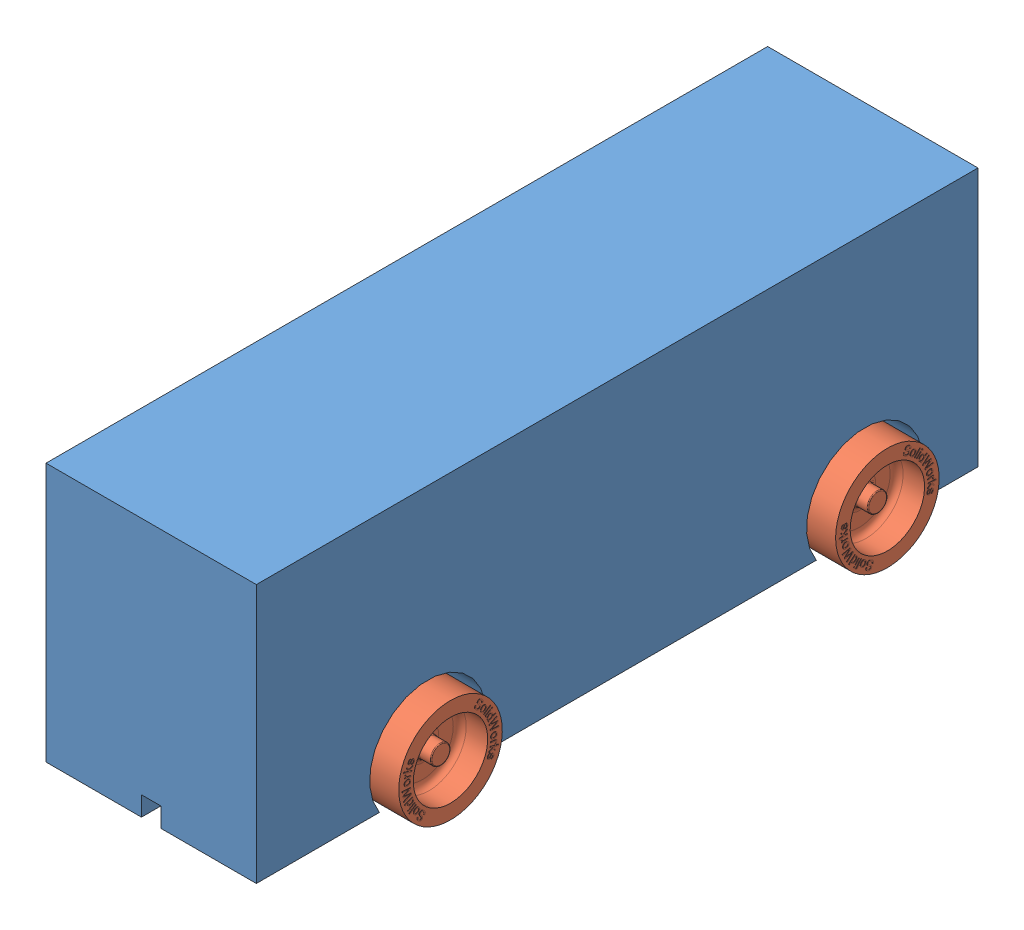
SolidWorks assembly Profil hatchback.SLDASM, configuration Initial Block (file format 9000). Lengths in mm.
Overall size (79.2 92.56 223).
7 component instances, 3 part files, 12 mates.
Components (placement in the parent):
- Bloc hatchback-1: Bloc hatchback.SLDPRT [ Initial Body] at origin size (65 80 223)
- Wheel-1: Wheel.SLDPRT [Default] at (24.8525 10 170) x (1 0 0) z (0 0.444542 0.895758)
- Wheel-2: Wheel.SLDPRT [Default] at (24.8525 10 35) x (1 0 0) z (0 -0.19026 -0.981734)
- Wheel-3: Wheel.SLDPRT [Default] at (-24.8525 10 35) x (-1 0 0) z (0 -0.609723 -0.792615)
- Wheel-4: Wheel.SLDPRT [Default] at (-24.8525 10 170) x (-1 0 0) z (0 0.757905 -0.652365)
- Axle-3: Axle.SLDPRT [Default] at (-32.5 10 35) size (65 3 3)
- Axle-4: Axle.SLDPRT [Default] at (-32.5 10 170) size (65 3 3)
Mates (geometry in assembly coordinates):
- Coaxiale1: concentric anti-aligned: cylinder of Bloc hatchback-1 through (-32.5 10 170) axis (1 0 0) radius 1.525; cylinder of Axle-4 through (32.5 10 170) axis (-1 0 0) radius 1.5
- Coïncidente1: coincident aligned: plane of Bloc hatchback-1 through (-32.5 0 223) normal (-1 0 0); plane of Axle-4 through (-32.5 10 170) normal (-1 0 0)
- Coaxiale2: concentric anti-aligned: cylinder of Bloc hatchback-1 through (-32.5 10 35) axis (1 0 0) radius 1.525; cylinder of Axle-3 through (32.5 10 35) axis (-1 0 0) radius 1.5
- Coïncidente2: coincident aligned: plane of Bloc hatchback-1 through (-32.5 0 223) normal (-1 0 0); plane of Axle-3 through (-32.5 10 35) normal (-1 0 0)
- Coaxiale3: concentric anti-aligned: cylinder of Wheel-3 through (-24.8525 10 35) axis (1 0 0) radius 3.125; cylinder of Axle-3 through (32.5 10 35) axis (-1 0 0) radius 1.5
- Distance1: distance = 3 mm anti-aligned: plane of Bloc hatchback-1 through (-17.5 10 35) normal (-1 0 0); plane of Wheel-3 through (-20.5 12.4769 33.0946) normal (1 0 0)
- Coaxiale4: concentric aligned: cylinder of Wheel-2 through (24.8525 10 35) axis (-1 0 0) radius 3.125; cylinder of Axle-3 through (32.5 10 35) axis (-1 0 0) radius 1.5
- Distance2: distance = 3 mm anti-aligned: plane of Wheel-2 through (20.5 6.9321 35.5946) normal (-1 0 0); plane of Bloc hatchback-1 through (17.5 10 35) normal (1 0 0)
- Coaxiale5: concentric anti-aligned: cylinder of Wheel-4 through (-24.8525 10 170) axis (1 0 0) radius 3.125; cylinder of Axle-4 through (32.5 10 170) axis (-1 0 0) radius 1.5
- Distance4: distance = 3 mm anti-aligned: plane of Wheel-4 through (-20.5 12.0386 172.3685) normal (1 0 0); plane of Bloc hatchback-1 through (-17.5 10 170) normal (-1 0 0)
- Coaxiale6: concentric aligned: cylinder of Wheel-1 through (24.8525 10 170) axis (-1 0 0) radius 3.125; cylinder of Axle-4 through (32.5 10 170) axis (-1 0 0) radius 1.5
- Distance5: distance = 3 mm anti-aligned: plane of Wheel-1 through (20.5 12.7992 168.6108) normal (-1 0 0); plane of Bloc hatchback-1 through (17.5 10 170) normal (1 0 0)
